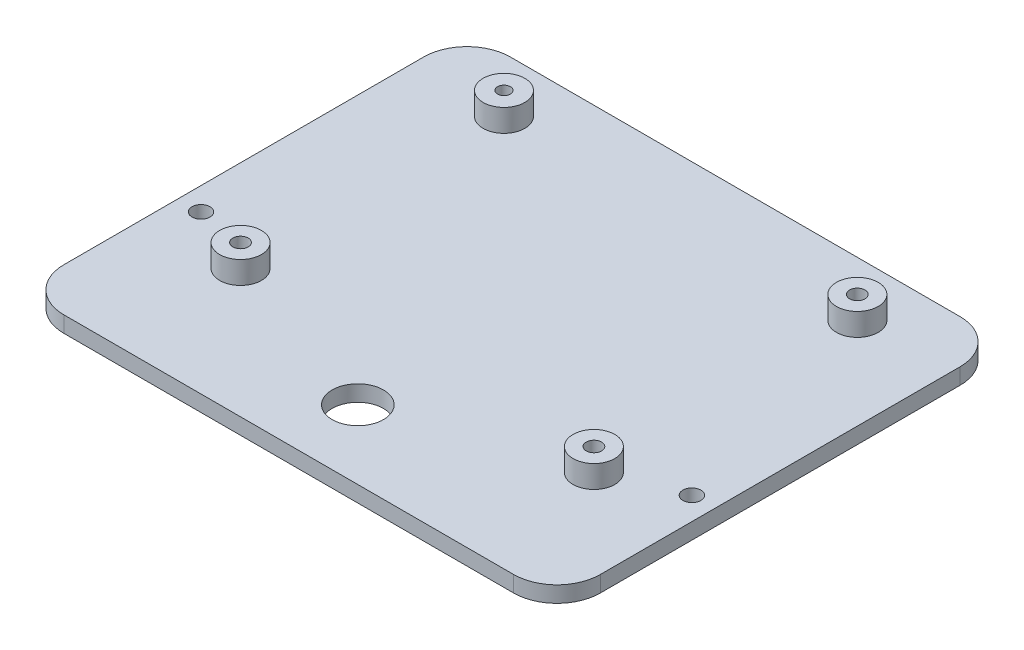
from build123d import *

# Parameters (mm, degrees)
SKETCH1_W              = 80
SKETCH1_H              = 36
SKETCH1_W_2            = 65
SKETCH1_H_2            = 17
BOSS_EXTRUDE2_DEPTH    = 2
SKETCH2_W              = 76
SKETCH2_H              = 29
SKETCH2_W_2            = 73
SKETCH2_H_2            = 26
BOSS_EXTRUDE3_DEPTH    = 3
SKETCH3_R              = 1.6
BOSS_EXTRUDE4_DEPTH    = 0.5
SKETCH5_W              = 76
SKETCH5_H              = 29
SKETCH5_W_2            = 73
SKETCH5_H_2            = 26
BOSS_EXTRUDE5_DEPTH    = 8
BOSS_EXTRUDE7_START    = -3
SKETCH7_R              = 1.6
BOSS_EXTRUDE7_DEPTH    = 3
SKETCH8_W              = 80
SKETCH8_H              = 36
CUT_EXTRUDE3_DEPTH     = 75
SKETCH9_W              = 89
SKETCH9_H              = 75
SKETCH9_W_2            = 84
SKETCH9_H_2            = 70
BOSS_EXTRUDE8_DEPTH    = 35
FILLET2_R              = 7
FILLET3_R              = 10
SKETCH10_W             = 65
SKETCH10_H             = 17
BOSS_EXTRUDE10_DEPTH   = 2
SKETCH12_W             = 76
SKETCH12_H             = 29
CUT_EXTRUDE4_DEPTH     = 3
BOSS_EXTRUDE11_START   = 6.5
SKETCH13_R             = 3
SKETCH13_R_2           = 1.6
BOSS_EXTRUDE11_DEPTH   = 6.5
SKETCH14_R             = 1.6
CUT_EXTRUDE5_DEPTH     = 6.5
SKETCH15_R             = 7.625
SKETCH15_R_2           = 3.5
SKETCH15_R_3           = 2.55
CUT_EXTRUDE6_DEPTH     = 6.5
BOSS_EXTRUDE12_START   = 30.5
BOSS_EXTRUDE12_DEPTH   = 30.5
SKETCH19_W             = 1
SKETCH19_H             = 25.8
BOSS_EXTRUDE14_DEPTH   = 30.5
BOSS_EXTRUDE15_START   = 30.5
BOSS_EXTRUDE15_DEPTH   = 30.5
SKETCH22_W             = 1
SKETCH22_H             = 21.1
BOSS_EXTRUDE16_DEPTH   = 30.5
SKETCH23_W             = 1
SKETCH23_H             = 6
BOSS_EXTRUDE17_DEPTH   = 24.5
SKETCH24_W             = 1
SKETCH24_H             = 6
BOSS_EXTRUDE18_DEPTH   = 26.5
SKETCH25_W             = 1
SKETCH25_H             = 6
BOSS_EXTRUDE19_DEPTH   = 24.5
CUT_EXTRUDE7_DEPTH     = 30.5
BOSS_EXTRUDE20_DEPTH   = 30.5
SKETCH29_W             = 6.6
SKETCH29_H             = 6.6
SKETCH29_W_2           = 5.6
BOSS_EXTRUDE21_DEPTH   = 30.5
BOSS_EXTRUDE22_START   = 6.5
BOSS_EXTRUDE22_DEPTH   = 6.5
SKETCH31_R             = 1.4
CUT_EXTRUDE8_DEPTH     = 15
BOSS_EXTRUDE23_START   = 3
SKETCH32_R             = 10.125
SKETCH32_R_2           = 7.625
BOSS_EXTRUDE23_DEPTH   = 3
BOSS_EXTRUDE24_START   = 4.5
SKETCH33_R             = 4.55
SKETCH33_R_2           = 2.55
BOSS_EXTRUDE24_DEPTH   = 4.5
SKETCH37_R             = 1.4
BOSS_EXTRUDE25_DEPTH   = 31.5
BOSS_EXTRUDE25_2_DEPTH = 31.5
BOSS_EXTRUDE26_START   = 2.5
BOSS_EXTRUDE26_DEPTH   = 2.5
SKETCH39_W             = 133.066875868
SKETCH39_H             = 132.977517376
CUT_EXTRUDE11_DEPTH    = 35
SKETCH40_R             = 1.4
CUT_EXTRUDE12_DEPTH    = 35
CUT_EXTRUDE13_DEPTH    = 35
SKETCH42_R             = 4
SKETCH42_R_2           = 1
SKETCH42_R_3           = 1.2
CUT_EXTRUDE14_DEPTH    = 10
SKETCH43_R             = 3.25
SKETCH43_R_2           = 1
SKETCH43_R_3           = 1.2
BOSS_EXTRUDE28_DEPTH   = 3.5
SKETCH45_W             = 12.852440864
SKETCH45_H             = 49.792844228
SKETCH45_W_2           = 9.951592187
SKETCH45_H_2           = 48.242595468
BOSS_EXTRUDE29_DEPTH   = 1


with BuildPart() as part:
    # Sketch1 → Boss-Extrude2 (new body)
    with BuildSketch(Plane(origin=(0, 0, 0), x_dir=(1, 0, 0), z_dir=(0, 1, 0))):
        with Locations((0.5, 0.7)):
            Rectangle(SKETCH1_W, SKETCH1_H)
        Rectangle(SKETCH1_W_2, SKETCH1_H_2, mode=Mode.SUBTRACT)
    extrude(amount=BOSS_EXTRUDE2_DEPTH)

    # Sketch2 → Boss-Extrude3 (add)
    with BuildSketch(Plane(origin=(0, 2, 0), x_dir=(1, 0, 0), z_dir=(0, 1, 0))):
        Rectangle(SKETCH2_W, SKETCH2_H)
        Rectangle(SKETCH2_W_2, SKETCH2_H_2, mode=Mode.SUBTRACT)
    extrude(amount=BOSS_EXTRUDE3_DEPTH)

    # Sketch3 → Boss-Extrude4 (add)
    with BuildSketch(Plane(origin=(0, 2, 0), x_dir=(1, 0, 0), z_dir=(0, 1, 0))):
        with BuildLine():
            ThreePointArc((-35.8, -15.2), (-35.840833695, -14.840833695), (-35.961250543, -14.5))
            Line((-35.961250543, -14.5), (-38, -14.5))
            Line((-38, -14.5), (-38, -13.716760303))
            ThreePointArc((-38, -13.716760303), (-38.294427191, -16.526649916), (-35.8, -15.2))
        make_face()
        with BuildLine():
            Line((-38, -14.5), (-35.961250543, -14.5))
            ThreePointArc((-35.961250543, -14.5), (-36.826204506, -13.706427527), (-38, -13.716760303))
            Line((-38, -13.716760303), (-38, -14.5))
        make_face()
        with BuildLine():
            ThreePointArc((36.961250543, -14.5), (38.040833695, -16.759166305), (40, -15.2))
            ThreePointArc((40, -15.2), (39.379795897, -13.935088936), (38, -13.650806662))
            Line((38, -13.650806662), (38, -14.5))
            Line((38, -14.5), (36.961250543, -14.5))
        make_face()
        with BuildLine():
            Line((38, -14.5), (38, -13.650806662))
            ThreePointArc((38, -13.650806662), (37.387314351, -13.961263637), (36.961250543, -14.5))
            Line((36.961250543, -14.5), (38, -14.5))
        make_face()
        with Locations(Location((38.4, 16.6, 0), (0, 0, 270))):
            Circle(SKETCH3_R)
        with Locations(Location((-37.4, 16.6, 0), (0, 0, 270))):
            Circle(SKETCH3_R)
    extrude(amount=BOSS_EXTRUDE4_DEPTH)

    # Sketch5 → Boss-Extrude5 (add)
    with BuildSketch(Plane(origin=(0, 5, 0), x_dir=(1, 0, 0), z_dir=(0, 1, 0))):
        Rectangle(SKETCH5_W, SKETCH5_H)
        Rectangle(SKETCH5_W_2, SKETCH5_H_2, mode=Mode.SUBTRACT)
    extrude(amount=-BOSS_EXTRUDE5_DEPTH)

    # Sketch7 → Boss-Extrude7 (add)
    with BuildSketch(Plane(origin=(0, 2.5, 0), x_dir=(1, 0, 0), z_dir=(0, 1, 0)).offset(BOSS_EXTRUDE7_START)):
        with Locations(Location((-37.4, 16.6, 0), (0, 0, 270))):
            Circle(SKETCH7_R)
        with Locations((-37.4, -15.2)):
            Circle(SKETCH7_R)
        with Locations((38.4, -15.2)):
            Circle(SKETCH7_R)
        with Locations(Location((38.4, 16.6, 0), (0, 0, 270))):
            Circle(SKETCH7_R)
    extrude(amount=BOSS_EXTRUDE7_DEPTH)

    # Sketch8 → Cut-Extrude3 (cut)
    with BuildSketch(Plane(origin=(0, 2, 0), x_dir=(1, 0, 0), z_dir=(0, 1, 0))):
        with Locations((0.5, 0.7)):
            Rectangle(SKETCH8_W, SKETCH8_H)
    extrude(amount=CUT_EXTRUDE3_DEPTH, mode=Mode.SUBTRACT)



with BuildPart() as body_2:
    # Sketch9 → Boss-Extrude8 (new body)
    with BuildSketch(Plane(origin=(0, 2, 0), x_dir=(1, 0, 0), z_dir=(0, 1, 0))):
        with Locations((0, -11.3)):
            Rectangle(SKETCH9_W, SKETCH9_H)
        with Locations((0, -11.3)):
            Rectangle(SKETCH9_W_2, SKETCH9_H_2, mode=Mode.SUBTRACT)
    extrude(amount=-BOSS_EXTRUDE8_DEPTH)

    # Fillet2
    fillet2_edges = [body_2.edges().sort_by_distance(p)[0] for p in [
        (-42, -15.5, -23.7),
        (-42, -15.5, 46.3),
        (42, -15.5, 46.3),
        (42, -15.5, -23.7),
    ]]
    fillet(fillet2_edges, radius=FILLET2_R)

    # Fillet3
    fillet3_edges = [body_2.edges().sort_by_distance(p)[0] for p in [
        (44.5, -15.5, 48.8),
        (-44.5, -15.5, 48.8),
        (-44.5, -15.5, -26.2),
        (44.5, -15.5, -26.2),
    ]]
    fillet(fillet3_edges, radius=FILLET3_R)


with BuildPart() as part_1:
    add(part.part)

    add(body_2.part)  # Boss-Extrude10 merges body 2
    # Sketch10 → Boss-Extrude10 (add)
    # profile 1 of 5: a face of its own
    with BuildSketch(Plane(origin=(0, 2, 0), x_dir=(1, 0, 0), z_dir=(0, 1, 0))):
        with BuildLine():
            Line((35, 23.7), (-35, 23.7))
            ThreePointArc((-35, 23.7), (-30.050252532, 21.649747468), (-28, 16.7))
            ThreePointArc((-28, 16.7), (-35, 9.7), (-42, 16.7))
            Line((-42, 16.7), (-42, -39.3))
            ThreePointArc((-42, -39.3), (-35, -32.3), (-28, -39.3))
            ThreePointArc((-28, -39.3), (-30.050252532, -44.249747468), (-35, -46.3))
            Line((-35, -46.3), (35, -46.3))
            ThreePointArc((35, -46.3), (30.050252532, -34.350252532), (42, -39.3))
            Line((42, -39.3), (42, 16.7))
            ThreePointArc((42, 16.7), (30.050252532, 11.750252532), (35, 23.7))
        make_face()
        Rectangle(SKETCH10_W, SKETCH10_H, mode=Mode.SUBTRACT)
    # profile 2 of 5: a face of its own
    with BuildSketch(Plane(origin=(0, 2, 0), x_dir=(1, 0, 0), z_dir=(0, 1, 0))):
        with BuildLine():
            ThreePointArc((-28, 16.7), (-30.050252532, 21.649747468), (-35, 23.7))
            ThreePointArc((-35, 23.7), (-39.949747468, 21.649747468), (-42, 16.7))
            ThreePointArc((-42, 16.7), (-35, 9.7), (-28, 16.7))
        make_face()
    # profile 3 of 5: a face of its own
    with BuildSketch(Plane(origin=(0, 2, 0), x_dir=(1, 0, 0), z_dir=(0, 1, 0))):
        with BuildLine():
            ThreePointArc((42, 16.7), (39.949747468, 21.649747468), (35, 23.7))
            ThreePointArc((35, 23.7), (30.050252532, 11.750252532), (42, 16.7))
        make_face()
    # profile 4 of 5: a face of its own
    with BuildSketch(Plane(origin=(0, 2, 0), x_dir=(1, 0, 0), z_dir=(0, 1, 0))):
        with BuildLine():
            ThreePointArc((35, -46.3), (39.949747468, -44.249747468), (42, -39.3))
            ThreePointArc((42, -39.3), (30.050252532, -34.350252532), (35, -46.3))
        make_face()
    # profile 5 of 5: a face of its own
    with BuildSketch(Plane(origin=(0, 2, 0), x_dir=(1, 0, 0), z_dir=(0, 1, 0))):
        with BuildLine():
            ThreePointArc((-28, -39.3), (-35, -32.3), (-42, -39.3))
            ThreePointArc((-42, -39.3), (-39.949747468, -44.249747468), (-35, -46.3))
            ThreePointArc((-35, -46.3), (-30.050252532, -44.249747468), (-28, -39.3))
        make_face()
    extrude(amount=-BOSS_EXTRUDE10_DEPTH)

    # Sketch12 → Cut-Extrude4 (cut)
    with BuildSketch(Plane.XZ.offset(3)):
        Rectangle(SKETCH12_W, SKETCH12_H)
    extrude(amount=-CUT_EXTRUDE4_DEPTH, mode=Mode.SUBTRACT)

    # Sketch13 → Boss-Extrude11 (add)
    # profile 1 of 8: a face of its own
    with BuildSketch(Plane(origin=(0, 0, 0), x_dir=(-1, 0, 0), z_dir=(0, -1, 0)).offset(BOSS_EXTRUDE11_START)):
        with Locations((-38.4, 16.6)):
            Circle(SKETCH13_R)
        with Locations(Location((-38.4, 16.6, 0), (0, 0, 270))):
            Circle(SKETCH13_R_2, mode=Mode.SUBTRACT)
    # profile 2 of 8: a face of its own
    with BuildSketch(Plane(origin=(0, 0, 0), x_dir=(-1, 0, 0), z_dir=(0, -1, 0)).offset(BOSS_EXTRUDE11_START)):
        with BuildLine():
            ThreePointArc((-38.4, 13.6), (-41.4, 16.6), (-38.4, 19.6))
            Line((-38.4, 19.6), (-41.371028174, 19.6))
            ThreePointArc((-41.371028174, 19.6), (-41.840950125, 18.18371203), (-42, 16.7))
            Line((-42, 16.7), (-42, 13.6))
            Line((-42, 13.6), (-38.4, 13.6))
        make_face()
    # profile 3 of 8: a face of its own
    with BuildSketch(Plane(origin=(0, 0, 0), x_dir=(-1, 0, 0), z_dir=(0, -1, 0)).offset(BOSS_EXTRUDE11_START)):
        with BuildLine():
            Line((41.371028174, 19.6), (37.4, 19.6))
            ThreePointArc((37.4, 19.6), (39.521320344, 18.721320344), (40.4, 16.6))
            ThreePointArc((40.4, 16.6), (39.521320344, 14.478679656), (37.4, 13.6))
            Line((37.4, 13.6), (42, 13.6))
            Line((42, 13.6), (42, 16.7))
            ThreePointArc((42, 16.7), (41.840950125, 18.18371203), (41.371028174, 19.6))
        make_face()
    # profile 4 of 8: a face of its own
    with BuildSketch(Plane(origin=(0, 0, 0), x_dir=(-1, 0, 0), z_dir=(0, -1, 0)).offset(BOSS_EXTRUDE11_START)):
        with Locations((37.4, 16.6)):
            Circle(SKETCH13_R)
        with Locations(Location((37.4, 16.6, 0), (0, 0, 270))):
            Circle(SKETCH13_R_2, mode=Mode.SUBTRACT)
    # profile 5 of 8: a face of its own
    with BuildSketch(Plane(origin=(0, 0, 0), x_dir=(-1, 0, 0), z_dir=(0, -1, 0)).offset(BOSS_EXTRUDE11_START)):
        with BuildLine():
            Line((42, -18.2), (42, -12.2))
            Line((42, -12.2), (37.4, -12.2))
            ThreePointArc((37.4, -12.2), (39.521320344, -13.078679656), (40.4, -15.2))
            ThreePointArc((40.4, -15.2), (39.521320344, -17.321320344), (37.4, -18.2))
            Line((37.4, -18.2), (42, -18.2))
        make_face()
    # profile 6 of 8: a face of its own
    with BuildSketch(Plane(origin=(0, 0, 0), x_dir=(-1, 0, 0), z_dir=(0, -1, 0)).offset(BOSS_EXTRUDE11_START)):
        with BuildLine():
            ThreePointArc((40.4, -15.2), (39.521320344, -13.078679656), (37.4, -12.2))
            ThreePointArc((37.4, -12.2), (34.4, -15.2), (37.4, -18.2))
            ThreePointArc((37.4, -18.2), (39.521320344, -17.321320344), (40.4, -15.2))
        make_face()
        with BuildLine():
            ThreePointArc((38, -13.716760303), (38.726649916, -14.305572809), (39, -15.2))
            ThreePointArc((39, -15.2), (37.040833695, -16.759166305), (35.961250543, -14.5))
            ThreePointArc((35.961250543, -14.5), (36.826204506, -13.706427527), (38, -13.716760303))
        make_face(mode=Mode.SUBTRACT)
    # profile 7 of 8: a face of its own
    with BuildSketch(Plane(origin=(0, 0, 0), x_dir=(-1, 0, 0), z_dir=(0, -1, 0)).offset(BOSS_EXTRUDE11_START)):
        with BuildLine():
            ThreePointArc((-35.4, -15.2), (-36.278679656, -13.078679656), (-38.4, -12.2))
            ThreePointArc((-38.4, -12.2), (-41.4, -15.2), (-38.4, -18.2))
            ThreePointArc((-38.4, -18.2), (-36.278679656, -17.321320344), (-35.4, -15.2))
        make_face()
        with BuildLine():
            ThreePointArc((-36.961250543, -14.5), (-36.840833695, -14.840833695), (-36.8, -15.2))
            ThreePointArc((-36.8, -15.2), (-39.664911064, -16.179795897), (-38, -13.650806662))
            ThreePointArc((-38, -13.650806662), (-37.387314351, -13.961263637), (-36.961250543, -14.5))
        make_face(mode=Mode.SUBTRACT)
    # profile 8 of 8: a face of its own
    with BuildSketch(Plane(origin=(0, 0, 0), x_dir=(-1, 0, 0), z_dir=(0, -1, 0)).offset(BOSS_EXTRUDE11_START)):
        with BuildLine():
            Line((-38.4, -12.2), (-42, -12.2))
            Line((-42, -12.2), (-42, -18.2))
            Line((-42, -18.2), (-38.4, -18.2))
            ThreePointArc((-38.4, -18.2), (-41.4, -15.2), (-38.4, -12.2))
        make_face()
    extrude(amount=-BOSS_EXTRUDE11_DEPTH)

    # Sketch14 → Cut-Extrude5 (cut)
    with BuildSketch(Plane(origin=(0, -6.5, 0), x_dir=(-1, 0, 0), z_dir=(0, -1, 0))):
        with Locations(Location((-38.4, 16.6, 0), (0, 0, 270))):
            Circle(SKETCH14_R)
        with Locations(Location((37.4, 16.6, 0), (0, 0, 270))):
            Circle(SKETCH14_R)
        with Locations(Location((37.4, -15.2, 0), (0, 0, 270))):
            Circle(SKETCH14_R)
        with Locations(Location((-38.4, -15.2, 0), (0, 0, 270))):
            Circle(SKETCH14_R)
    extrude(amount=-CUT_EXTRUDE5_DEPTH, mode=Mode.SUBTRACT)

    # Sketch15 → Cut-Extrude6 (cut)
    with BuildSketch(Plane.XZ):
        with Locations(Location((-24.375, 28.90390523, 0), (0, 0, 270))):
            Circle(SKETCH15_R)
        with Locations(Location((20.25, 28.90390523, 0), (0, 0, 270))):
            Circle(SKETCH15_R_2)
        with Locations(Location((-4.5, 28.90390523, 0), (0, 0, 270))):
            Circle(SKETCH15_R_3)
    extrude(amount=-CUT_EXTRUDE6_DEPTH, mode=Mode.SUBTRACT)

    # Sketch18 → Boss-Extrude12 (add)
    with BuildSketch(Plane(origin=(0, 0, 0), x_dir=(-1, 0, 0), z_dir=(0, -1, 0)).offset(BOSS_EXTRUDE12_START)):
        with BuildLine():
            Line((-38.4, 19.6), (-28.628971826, 19.6))
            ThreePointArc((-28.628971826, 19.6), (-31.211860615, 22.586425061), (-35, 23.7))
            ThreePointArc((-35, 23.7), (-38.788139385, 22.586425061), (-41.371028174, 19.6))
            Line((-41.371028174, 19.6), (-38.4, 19.6))
        make_face()
        with BuildLine():
            Line((-28.628971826, 19.6), (28.628971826, 19.6))
            ThreePointArc((28.628971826, 19.6), (31.211860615, 22.586425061), (35, 23.7))
            Line((35, 23.7), (-35, 23.7))
            ThreePointArc((-35, 23.7), (-31.211860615, 22.586425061), (-28.628971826, 19.6))
        make_face()
        with BuildLine():
            Line((28.628971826, 19.6), (37.4, 19.6))
            Line((37.4, 19.6), (41.371028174, 19.6))
            ThreePointArc((41.371028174, 19.6), (38.788139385, 22.586425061), (35, 23.7))
            ThreePointArc((35, 23.7), (31.211860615, 22.586425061), (28.628971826, 19.6))
        make_face()
    extrude(amount=-BOSS_EXTRUDE12_DEPTH)

    # Sketch19 → Boss-Extrude14 (add)
    with BuildSketch(Plane(origin=(0, 0, 0), x_dir=(-1, 0, 0), z_dir=(0, -1, 0))):
        with Locations((-41.5, 0.7)):
            Rectangle(SKETCH19_W, SKETCH19_H)
        with Locations((41.5, 0.7)):
            Rectangle(SKETCH19_W, SKETCH19_H)
    extrude(amount=BOSS_EXTRUDE14_DEPTH)

    # Sketch20 → Boss-Extrude15 (add)
    with BuildSketch(Plane(origin=(0, 0, 0), x_dir=(-1, 0, 0), z_dir=(0, -1, 0)).offset(BOSS_EXTRUDE15_START)):
        with BuildLine():
            Line((42, -39.3), (28, -39.3))
            ThreePointArc((28, -39.3), (30.050252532, -44.249747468), (35, -46.3))
            ThreePointArc((35, -46.3), (39.949747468, -44.249747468), (42, -39.3))
        make_face()
        with BuildLine():
            Line((28, -39.3), (-28, -39.3))
            ThreePointArc((-28, -39.3), (-30.050252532, -44.249747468), (-35, -46.3))
            Line((-35, -46.3), (35, -46.3))
            ThreePointArc((35, -46.3), (30.050252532, -44.249747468), (28, -39.3))
        make_face()
        with BuildLine():
            Line((-28, -39.3), (-42, -39.3))
            ThreePointArc((-42, -39.3), (-39.949747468, -44.249747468), (-35, -46.3))
            ThreePointArc((-35, -46.3), (-30.050252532, -44.249747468), (-28, -39.3))
        make_face()
    extrude(amount=-BOSS_EXTRUDE15_DEPTH)

    # Sketch22 → Boss-Extrude16 (add)
    with BuildSketch(Plane(origin=(0, 0, 0), x_dir=(-1, 0, 0), z_dir=(0, -1, 0))):
        with Locations((-41.5, -28.75)):
            Rectangle(SKETCH22_W, SKETCH22_H)
        with Locations((41.5, -28.75)):
            Rectangle(SKETCH22_W, SKETCH22_H)
    extrude(amount=BOSS_EXTRUDE16_DEPTH)

    # Sketch23 → Boss-Extrude17 (add)
    with BuildSketch(Plane(origin=(0, -30.5, 0), x_dir=(-1, 0, 0), z_dir=(0, -1, 0))):
        with Locations((41.5, -15.2)):
            Rectangle(SKETCH23_W, SKETCH23_H)
    extrude(amount=-BOSS_EXTRUDE17_DEPTH)

    # Sketch24 → Boss-Extrude18 (add)
    with BuildSketch(Plane(origin=(0, -30.5, 0), x_dir=(-1, 0, 0), z_dir=(0, -1, 0))):
        with Locations((41.5, 16.6)):
            Rectangle(SKETCH24_W, SKETCH24_H)
        with Locations((-41.5, 16.6)):
            Rectangle(SKETCH24_W, SKETCH24_H)
    extrude(amount=-BOSS_EXTRUDE18_DEPTH)

    # Sketch25 → Boss-Extrude19 (add)
    with BuildSketch(Plane(origin=(0, -30.5, 0), x_dir=(-1, 0, 0), z_dir=(0, -1, 0))):
        with Locations((-41.5, -15.2)):
            Rectangle(SKETCH25_W, SKETCH25_H)
    extrude(amount=-BOSS_EXTRUDE19_DEPTH)

    # Sketch27 → Cut-Extrude7 (cut)
    with BuildSketch(Plane(origin=(0, -30.5, 0), x_dir=(-1, 0, 0), z_dir=(0, -1, 0))):
        with BuildLine():
            ThreePointArc((40.252618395, -42.2), (40.810151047, -40.797379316), (41, -39.3))
            Line((41, -39.3), (-41, -39.3))
            ThreePointArc((-41, -39.3), (-40.810151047, -40.797379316), (-40.252618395, -42.2))
            Line((-40.252618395, -42.2), (40.252618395, -42.2))
        make_face()
    extrude(amount=-CUT_EXTRUDE7_DEPTH, mode=Mode.SUBTRACT)

    # Sketch28 → Boss-Extrude20 (add)
    with BuildSketch(Plane(origin=(0, -30.5, 0), x_dir=(-1, 0, 0), z_dir=(0, -1, 0))):
        with BuildLine():
            Line((-41, 19.6), (-41, 16.7))
            ThreePointArc((-41, 16.7), (-40.810151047, 18.197379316), (-40.252618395, 19.6))
            Line((-40.252618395, 19.6), (-41, 19.6))
        make_face()
        with BuildLine():
            Line((41, 19.6), (40.213973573, 19.6))
            ThreePointArc((40.213973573, 19.6), (40.800011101, 18.202318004), (41, 16.7))
            Line((41, 16.7), (41, 19.6))
        make_face()
    extrude(amount=-BOSS_EXTRUDE20_DEPTH)

    # Sketch29 → Boss-Extrude21 (add)
    with BuildSketch(Plane(origin=(0, 0, 0), x_dir=(-1, 0, 0), z_dir=(0, -1, 0))):
        with Locations((37.7, -21.5)):
            Rectangle(SKETCH29_W, SKETCH29_H)
        with Locations((-38.2, -21.5)):
            Rectangle(SKETCH29_W_2, SKETCH29_H)
    extrude(amount=BOSS_EXTRUDE21_DEPTH)

    # Sketch30 → Boss-Extrude22 (add)
    with BuildSketch(Plane(origin=(0, 0, 0), x_dir=(-1, 0, 0), z_dir=(0, -1, 0)).offset(BOSS_EXTRUDE22_START)):
        with BuildLine():
            Line((34.4, -15.2), (34.4, -18.2))
            Line((34.4, -18.2), (37.4, -18.2))
            ThreePointArc((37.4, -18.2), (35.278679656, -17.321320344), (34.4, -15.2))
        make_face()
        with BuildLine():
            ThreePointArc((-35.4, -15.2), (-36.278679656, -17.321320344), (-38.4, -18.2))
            Line((-38.4, -18.2), (-35.4, -18.2))
            Line((-35.4, -18.2), (-35.4, -15.2))
        make_face()
    extrude(amount=-BOSS_EXTRUDE22_DEPTH)

    # Sketch31 → Cut-Extrude8 (cut)
    with BuildSketch(Plane(origin=(0, -30.5, 0), x_dir=(-1, 0, 0), z_dir=(0, -1, 0))):
        with Locations(Location((-38.2, -21.5, 0), (0, 0, 90))):
            Circle(SKETCH31_R)
        with Locations(Location((38.2, -21.5, 0), (0, 0, 90))):
            Circle(SKETCH31_R)
    extrude(amount=-CUT_EXTRUDE8_DEPTH, mode=Mode.SUBTRACT)

    # Sketch32 → Boss-Extrude23 (add)
    with BuildSketch(Plane(origin=(0, 0, 0), x_dir=(-1, 0, 0), z_dir=(0, -1, 0)).offset(BOSS_EXTRUDE23_START)):
        with Locations(Location((24.375, -28.90390523, 0), (0, 0, 270))):
            Circle(SKETCH32_R)
        with Locations(Location((24.375, -28.90390523, 0), (0, 0, 90))):
            Circle(SKETCH32_R_2, mode=Mode.SUBTRACT)
    extrude(amount=-BOSS_EXTRUDE23_DEPTH)

    # Sketch33 → Boss-Extrude24 (add)
    with BuildSketch(Plane(origin=(0, 0, 0), x_dir=(-1, 0, 0), z_dir=(0, -1, 0)).offset(BOSS_EXTRUDE24_START)):
        with Locations(Location((4.5, -28.90390523, 0), (0, 0, 270))):
            Circle(SKETCH33_R)
        with Locations(Location((4.5, -28.90390523, 0), (0, 0, 90))):
            Circle(SKETCH33_R_2, mode=Mode.SUBTRACT)
    extrude(amount=-BOSS_EXTRUDE24_DEPTH)


with BuildPart() as body_2_2:
    # Sketch37 → Boss-Extrude25 (new body)
    with BuildSketch(Plane(origin=(0, -30.5, 0), x_dir=(-1, 0, 0), z_dir=(0, -1, 0))):
        with Locations(Location((38.2, -21.5, 0), (0, 0, 90))):
            Circle(SKETCH37_R)
    extrude(amount=BOSS_EXTRUDE25_DEPTH)



with BuildPart() as body_3:
    # Sketch37 → Boss-Extrude25 2 (new body)
    with BuildSketch(Plane(origin=(0, -30.5, 0), x_dir=(-1, 0, 0), z_dir=(0, -1, 0))):
        with Locations(Location((-38.2, -21.5, 0), (0, 0, 90))):
            Circle(SKETCH37_R)
    extrude(amount=BOSS_EXTRUDE25_2_DEPTH)


with BuildPart() as body_2_2_1:
    add(body_2_2.part)

    add(body_3.part)  # Boss-Extrude26 merges body 3
    # Sketch38 → Boss-Extrude26 (add)
    with BuildSketch(Plane(origin=(0, -33, 0), x_dir=(-1, 0, 0), z_dir=(0, -1, 0)).offset(BOSS_EXTRUDE26_START)):
        with BuildLine():
            Line((35, 23.7), (-35, 23.7))
            ThreePointArc((-35, 23.7), (-30.050252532, 21.649747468), (-28, 16.7))
            ThreePointArc((-28, 16.7), (-35, 9.7), (-42, 16.7))
            Line((-42, 16.7), (-42, -39.3))
            ThreePointArc((-42, -39.3), (-35, -32.3), (-28, -39.3))
            ThreePointArc((-28, -39.3), (-30.050252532, -44.249747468), (-35, -46.3))
            Line((-35, -46.3), (35, -46.3))
            ThreePointArc((35, -46.3), (30.050252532, -34.350252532), (42, -39.3))
            Line((42, -39.3), (42, 16.7))
            ThreePointArc((42, 16.7), (30.050252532, 11.750252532), (35, 23.7))
        make_face()
        with BuildLine():
            ThreePointArc((-28, 16.7), (-30.050252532, 21.649747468), (-35, 23.7))
            ThreePointArc((-35, 23.7), (-39.949747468, 21.649747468), (-42, 16.7))
            ThreePointArc((-42, 16.7), (-35, 9.7), (-28, 16.7))
        make_face()
        with BuildLine():
            ThreePointArc((42, 16.7), (39.949747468, 21.649747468), (35, 23.7))
            ThreePointArc((35, 23.7), (30.050252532, 11.750252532), (42, 16.7))
        make_face()
        with BuildLine():
            ThreePointArc((35, -46.3), (39.949747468, -44.249747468), (42, -39.3))
            ThreePointArc((42, -39.3), (30.050252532, -34.350252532), (35, -46.3))
        make_face()
        with BuildLine():
            ThreePointArc((-28, -39.3), (-35, -32.3), (-42, -39.3))
            ThreePointArc((-42, -39.3), (-39.949747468, -44.249747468), (-35, -46.3))
            ThreePointArc((-35, -46.3), (-30.050252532, -44.249747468), (-28, -39.3))
        make_face()
    extrude(amount=-BOSS_EXTRUDE26_DEPTH)


with BuildPart() as cut_extrude11_tool:
    # Sketch39 → Cut-Extrude11 (new body)
    with BuildSketch(Plane(origin=(0, 2, 0), x_dir=(1, 0, 0), z_dir=(0, 1, 0))):
        Rectangle(SKETCH39_W, SKETCH39_H)
    extrude(amount=-CUT_EXTRUDE11_DEPTH)


with BuildPart() as part_2:
    add(part_1.part)

    # Cut-Extrude11: cut by cut_extrude11_tool
    add(cut_extrude11_tool.part, mode=Mode.SUBTRACT)


with BuildPart() as body_2_2_2:
    add(body_2_2_1.part)

    # Cut-Extrude11: cut by cut_extrude11_tool
    add(cut_extrude11_tool.part, mode=Mode.SUBTRACT)

    # Sketch40 → Cut-Extrude12 (cut)
    with BuildSketch(Plane(origin=(0, -62, 0), x_dir=(-1, 0, 0), z_dir=(0, -1, 0))):
        with Locations(Location((-38.2, -21.5, 0), (0, 0, 90))):
            Circle(SKETCH40_R)
        with Locations(Location((38.2, -21.5, 0), (0, 0, 90))):
            Circle(SKETCH40_R)
    extrude(amount=-CUT_EXTRUDE12_DEPTH, mode=Mode.SUBTRACT)

    # Sketch41 → Cut-Extrude13 (cut)
    with BuildSketch(Plane.XZ.offset(35.5)):
        with BuildLine():
            Line((36.854049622, -23.45), (35, -23.45))
            Line((35, -23.45), (-35, -23.45))
            Line((-35, -23.45), (-36.854049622, -23.45))
            ThreePointArc((-36.854049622, -23.45), (-35.935414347, -23.637218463), (-35, -23.7))
            Line((-35, -23.7), (35, -23.7))
            ThreePointArc((35, -23.7), (35.935414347, -23.637218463), (36.854049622, -23.45))
        make_face()
        with BuildLine():
            Line((41.75, -18.554049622), (41.75, -16.7))
            ThreePointArc((41.75, -16.7), (39.772970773, -21.472970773), (35, -23.45))
            Line((35, -23.45), (36.854049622, -23.45))
            ThreePointArc((36.854049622, -23.45), (39.949747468, -21.649747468), (41.75, -18.554049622))
        make_face()
        with BuildLine():
            ThreePointArc((42, 39.3), (41.937218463, 40.235414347), (41.75, 41.154049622))
            Line((41.75, 41.154049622), (41.75, 39.3))
            Line((41.75, 39.3), (41.75, -16.7))
            Line((41.75, -16.7), (41.75, -18.554049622))
            ThreePointArc((41.75, -18.554049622), (41.937218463, -17.635414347), (42, -16.7))
            Line((42, -16.7), (42, 39.3))
        make_face()
        with BuildLine():
            ThreePointArc((41.75, 41.154049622), (39.949747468, 44.249747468), (36.854049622, 46.05))
            Line((36.854049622, 46.05), (35, 46.05))
            ThreePointArc((35, 46.05), (39.772970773, 44.072970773), (41.75, 39.3))
            Line((41.75, 39.3), (41.75, 41.154049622))
        make_face()
        with BuildLine():
            Line((35, 46.05), (36.854049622, 46.05))
            ThreePointArc((36.854049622, 46.05), (35.935414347, 46.237218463), (35, 46.3))
            Line((35, 46.3), (-35, 46.3))
            ThreePointArc((-35, 46.3), (-35.935414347, 46.237218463), (-36.854049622, 46.05))
            Line((-36.854049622, 46.05), (-34.999999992, 46.05))
            Line((-34.999999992, 46.05), (35, 46.05))
        make_face()
        with BuildLine():
            ThreePointArc((-41.75, 39.3), (-39.77297077, 44.072970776), (-34.999999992, 46.05))
            Line((-34.999999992, 46.05), (-36.854049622, 46.05))
            ThreePointArc((-36.854049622, 46.05), (-39.949747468, 44.249747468), (-41.75, 41.154049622))
            Line((-41.75, 41.154049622), (-41.75, 39.3))
        make_face()
        with BuildLine():
            Line((-41.75, -16.7), (-41.75, 39.3))
            Line((-41.75, 39.3), (-41.75, 41.154049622))
            ThreePointArc((-41.75, 41.154049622), (-41.937218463, 40.235414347), (-42, 39.3))
            Line((-42, 39.3), (-42, -16.7))
            ThreePointArc((-42, -16.7), (-41.937218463, -17.635414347), (-41.75, -18.554049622))
            Line((-41.75, -18.554049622), (-41.75, -16.7))
        make_face()
        with BuildLine():
            ThreePointArc((-35, -23.45), (-39.772970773, -21.472970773), (-41.75, -16.7))
            Line((-41.75, -16.7), (-41.75, -18.554049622))
            ThreePointArc((-41.75, -18.554049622), (-39.949747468, -21.649747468), (-36.854049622, -23.45))
            Line((-36.854049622, -23.45), (-35, -23.45))
        make_face()
    extrude(amount=-CUT_EXTRUDE13_DEPTH, mode=Mode.SUBTRACT)

    # Sketch42 → Cut-Extrude14 (cut)
    with BuildSketch(Plane(origin=(0, -33, 0), x_dir=(1, 0, 0), z_dir=(0, 1, 0))):
        with Locations(Location((0, -35.3, 0), (0, 0, 270))):
            Circle(SKETCH42_R)
        with Locations(Location((-27.5, 14.95, 0), (0, 0, 270))):
            Circle(SKETCH42_R_2)
        with Locations(Location((27.5, 14.95, 0), (0, 0, 270))):
            Circle(SKETCH42_R_3)
        with Locations(Location((-27.5, -26.05, 0), (0, 0, 270))):
            Circle(SKETCH42_R_3)
        with Locations(Location((27.5, -26.05, 0), (0, 0, 270))):
            Circle(SKETCH42_R_3)
    extrude(amount=-CUT_EXTRUDE14_DEPTH, mode=Mode.SUBTRACT)

    # Sketch43 → Boss-Extrude28 (add)
    # profile 1 of 4: a face of its own
    with BuildSketch(Plane(origin=(0, -33, 0), x_dir=(1, 0, 0), z_dir=(0, 1, 0))):
        with Locations(Location((-27.5, 14.95, 0), (0, 0, 90))):
            Circle(SKETCH43_R)
        with Locations(Location((-27.5, 14.95, 0), (0, 0, 270))):
            Circle(SKETCH43_R_2, mode=Mode.SUBTRACT)
    # profile 2 of 4: a face of its own
    with BuildSketch(Plane(origin=(0, -33, 0), x_dir=(1, 0, 0), z_dir=(0, 1, 0))):
        with Locations(Location((27.5, 14.95, 0), (0, 0, 90))):
            Circle(SKETCH43_R)
        with Locations(Location((27.5, 14.95, 0), (0, 0, 270))):
            Circle(SKETCH43_R_3, mode=Mode.SUBTRACT)
    # profile 3 of 4: a face of its own
    with BuildSketch(Plane(origin=(0, -33, 0), x_dir=(1, 0, 0), z_dir=(0, 1, 0))):
        with Locations(Location((27.5, -26.05, 0), (0, 0, 90))):
            Circle(SKETCH43_R)
        with Locations(Location((27.5, -26.05, 0), (0, 0, 270))):
            Circle(SKETCH43_R_3, mode=Mode.SUBTRACT)
    # profile 4 of 4: a face of its own
    with BuildSketch(Plane(origin=(0, -33, 0), x_dir=(1, 0, 0), z_dir=(0, 1, 0))):
        with Locations(Location((-27.5, -26.05, 0), (0, 0, 90))):
            Circle(SKETCH43_R)
        with Locations(Location((-27.5, -26.05, 0), (0, 0, 270))):
            Circle(SKETCH43_R_3, mode=Mode.SUBTRACT)
    extrude(amount=BOSS_EXTRUDE28_DEPTH)

    # Sketch45 → Boss-Extrude29 (add)
    with BuildSketch(Plane(origin=(0, -35.5, 0), x_dir=(-1, 0, 0), z_dir=(0, -1, 0))):
        with Locations((-27.207679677, -6.526014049)):
            Rectangle(SKETCH45_W, SKETCH45_H)
        with Locations((27.155862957, -7.301138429)):
            Rectangle(SKETCH45_W_2, SKETCH45_H_2)
    extrude(amount=-BOSS_EXTRUDE29_DEPTH)


solid = body_2_2_2.part
